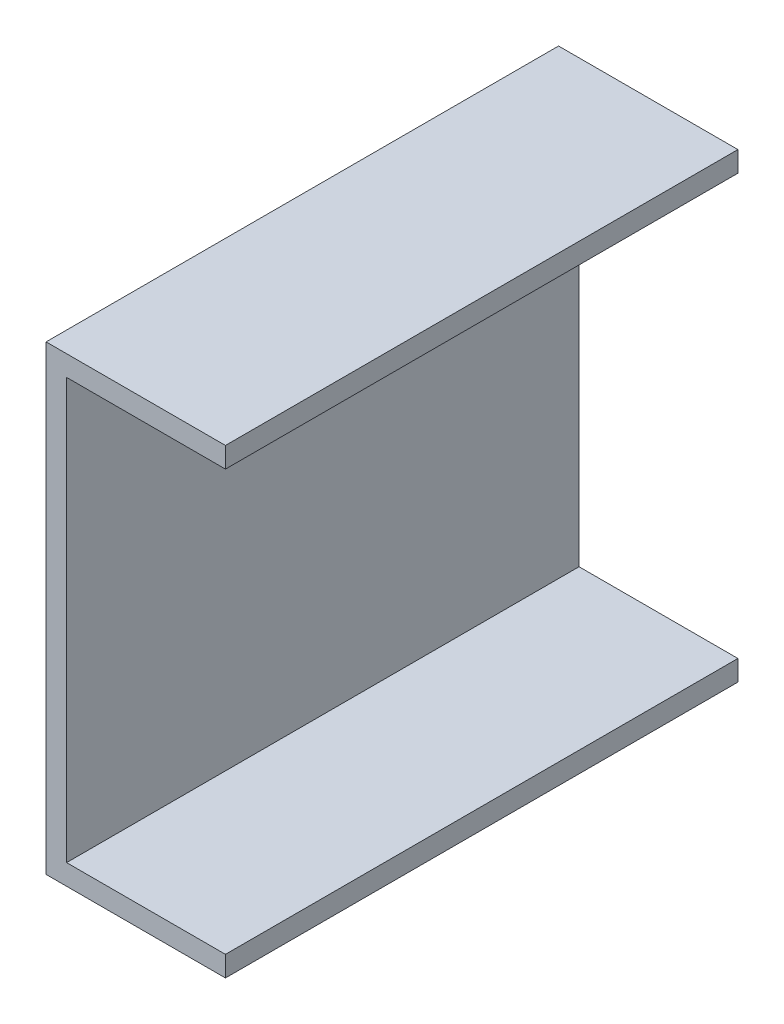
ISO-10303-21;
HEADER;
FILE_DESCRIPTION(('STEP AP214'),'2;1');
FILE_NAME('part.step','',(''),(''),'','','');
FILE_SCHEMA(('AUTOMOTIVE_DESIGN { 1 0 10303 214 1 1 1 1 }'));
ENDSEC;
DATA;
#1=APPLICATION_CONTEXT('core data for automotive mechanical design processes');
#2=APPLICATION_PROTOCOL_DEFINITION('international standard','automotive_design',2000,#1);
#3=PRODUCT_CONTEXT('',#1,'mechanical');
#4=PRODUCT('Part','Part','',(#3));
#5=PRODUCT_RELATED_PRODUCT_CATEGORY('part','',(#4));
#6=PRODUCT_DEFINITION_FORMATION('','',#4);
#7=PRODUCT_DEFINITION_CONTEXT('part definition',#1,'design');
#8=PRODUCT_DEFINITION('design','',#6,#7);
#9=PRODUCT_DEFINITION_SHAPE('','',#8);
#10=(LENGTH_UNIT() NAMED_UNIT(*) SI_UNIT(.MILLI.,.METRE.));
#11=(NAMED_UNIT(*) PLANE_ANGLE_UNIT() SI_UNIT($,.RADIAN.));
#12=(NAMED_UNIT(*) SI_UNIT($,.STERADIAN.) SOLID_ANGLE_UNIT());
#13=UNCERTAINTY_MEASURE_WITH_UNIT(LENGTH_MEASURE(1.E-05),#10,'distance_accuracy_value','');
#14=(GEOMETRIC_REPRESENTATION_CONTEXT(3) GLOBAL_UNCERTAINTY_ASSIGNED_CONTEXT((#13)) GLOBAL_UNIT_ASSIGNED_CONTEXT((#10,
#11,#12)) REPRESENTATION_CONTEXT('',''));
#15=CARTESIAN_POINT('',(0.,0.,0.));
#16=DIRECTION('',(0.,0.,1.));
#17=DIRECTION('',(1.,0.,0.));
#18=AXIS2_PLACEMENT_3D('',#15,#16,#17);
#19=CARTESIAN_POINT('',(0.,0.,200.));
#20=DIRECTION('',(1.,0.,0.));
#21=DIRECTION('',(0.,0.,-1.));
#22=AXIS2_PLACEMENT_3D('',#19,#20,#21);
#23=PLANE('',#22);
#24=DIRECTION('',(0.,-1.,0.));
#25=VECTOR('',#24,1.);
#26=CARTESIAN_POINT('',(0.,0.,0.));
#27=LINE('',#26,#25);
#28=CARTESIAN_POINT('',(0.,180.,0.));
#29=VERTEX_POINT('',#28);
#30=CARTESIAN_POINT('',(0.,0.,0.));
#31=VERTEX_POINT('',#30);
#32=EDGE_CURVE('E97',#29,#31,#27,.T.);
#33=ORIENTED_EDGE('',*,*,#32,.T.);
#34=DIRECTION('',(0.,0.,-1.));
#35=VECTOR('',#34,1.);
#36=CARTESIAN_POINT('',(0.,0.,200.));
#37=LINE('',#36,#35);
#38=CARTESIAN_POINT('',(0.,0.,200.));
#39=VERTEX_POINT('',#38);
#40=EDGE_CURVE('E11',#39,#31,#37,.T.);
#41=ORIENTED_EDGE('',*,*,#40,.F.);
#42=DIRECTION('',(0.,-1.,0.));
#43=VECTOR('',#42,1.);
#44=CARTESIAN_POINT('',(0.,0.,200.));
#45=LINE('',#44,#43);
#46=CARTESIAN_POINT('',(0.,180.,200.));
#47=VERTEX_POINT('',#46);
#48=EDGE_CURVE('E124',#47,#39,#45,.T.);
#49=ORIENTED_EDGE('',*,*,#48,.F.);
#50=DIRECTION('',(0.,0.,-1.));
#51=VECTOR('',#50,1.);
#52=CARTESIAN_POINT('',(0.,180.,200.));
#53=LINE('',#52,#51);
#54=EDGE_CURVE('E110',#47,#29,#53,.T.);
#55=ORIENTED_EDGE('',*,*,#54,.T.);
#56=EDGE_LOOP('',(#33,#41,#49,#55));
#57=FACE_BOUND('',#56,.T.);
#58=ADVANCED_FACE('F29',(#57),#23,.F.);
#59=CARTESIAN_POINT('',(0.,0.,200.));
#60=DIRECTION('',(0.,1.,0.));
#61=DIRECTION('',(0.,0.,1.));
#62=AXIS2_PLACEMENT_3D('',#59,#60,#61);
#63=PLANE('',#62);
#64=DIRECTION('',(1.,0.,0.));
#65=VECTOR('',#64,1.);
#66=CARTESIAN_POINT('',(0.,0.,0.));
#67=LINE('',#66,#65);
#68=CARTESIAN_POINT('',(70.,0.,0.));
#69=VERTEX_POINT('',#68);
#70=EDGE_CURVE('E93',#31,#69,#67,.T.);
#71=ORIENTED_EDGE('',*,*,#70,.T.);
#72=DIRECTION('',(0.,0.,-1.));
#73=VECTOR('',#72,1.);
#74=CARTESIAN_POINT('',(70.,0.,200.));
#75=LINE('',#74,#73);
#76=CARTESIAN_POINT('',(70.,0.,200.));
#77=VERTEX_POINT('',#76);
#78=EDGE_CURVE('E36',#77,#69,#75,.T.);
#79=ORIENTED_EDGE('',*,*,#78,.F.);
#80=DIRECTION('',(1.,0.,0.));
#81=VECTOR('',#80,1.);
#82=CARTESIAN_POINT('',(0.,0.,200.));
#83=LINE('',#82,#81);
#84=EDGE_CURVE('E106',#39,#77,#83,.T.);
#85=ORIENTED_EDGE('',*,*,#84,.F.);
#86=ORIENTED_EDGE('',*,*,#40,.T.);
#87=EDGE_LOOP('',(#71,#79,#85,#86));
#88=FACE_BOUND('',#87,.T.);
#89=ADVANCED_FACE('F105',(#88),#63,.F.);
#90=CARTESIAN_POINT('',(70.,0.,200.));
#91=DIRECTION('',(-1.,0.,0.));
#92=DIRECTION('',(0.,0.,1.));
#93=AXIS2_PLACEMENT_3D('',#90,#91,#92);
#94=PLANE('',#93);
#95=DIRECTION('',(0.,1.,0.));
#96=VECTOR('',#95,1.);
#97=CARTESIAN_POINT('',(70.,0.,0.));
#98=LINE('',#97,#96);
#99=CARTESIAN_POINT('',(70.,8.,0.));
#100=VERTEX_POINT('',#99);
#101=EDGE_CURVE('E99',#69,#100,#98,.T.);
#102=ORIENTED_EDGE('',*,*,#101,.T.);
#103=DIRECTION('',(0.,0.,-1.));
#104=VECTOR('',#103,1.);
#105=CARTESIAN_POINT('',(70.,8.,200.));
#106=LINE('',#105,#104);
#107=CARTESIAN_POINT('',(70.,8.,200.));
#108=VERTEX_POINT('',#107);
#109=EDGE_CURVE('E150',#108,#100,#106,.T.);
#110=ORIENTED_EDGE('',*,*,#109,.F.);
#111=DIRECTION('',(0.,1.,0.));
#112=VECTOR('',#111,1.);
#113=CARTESIAN_POINT('',(70.,0.,200.));
#114=LINE('',#113,#112);
#115=EDGE_CURVE('E127',#77,#108,#114,.T.);
#116=ORIENTED_EDGE('',*,*,#115,.F.);
#117=ORIENTED_EDGE('',*,*,#78,.T.);
#118=EDGE_LOOP('',(#102,#110,#116,#117));
#119=FACE_BOUND('',#118,.T.);
#120=ADVANCED_FACE('F154',(#119),#94,.F.);
#121=CARTESIAN_POINT('',(8.,8.,200.));
#122=DIRECTION('',(0.,-1.,0.));
#123=DIRECTION('',(0.,0.,-1.));
#124=AXIS2_PLACEMENT_3D('',#121,#122,#123);
#125=PLANE('',#124);
#126=DIRECTION('',(-1.,0.,0.));
#127=VECTOR('',#126,1.);
#128=CARTESIAN_POINT('',(8.,8.,0.));
#129=LINE('',#128,#127);
#130=CARTESIAN_POINT('',(8.,8.,0.));
#131=VERTEX_POINT('',#130);
#132=EDGE_CURVE('E114',#100,#131,#129,.T.);
#133=ORIENTED_EDGE('',*,*,#132,.T.);
#134=DIRECTION('',(0.,0.,-1.));
#135=VECTOR('',#134,1.);
#136=CARTESIAN_POINT('',(8.,8.,200.));
#137=LINE('',#136,#135);
#138=CARTESIAN_POINT('',(8.,8.,200.));
#139=VERTEX_POINT('',#138);
#140=EDGE_CURVE('E147',#139,#131,#137,.T.);
#141=ORIENTED_EDGE('',*,*,#140,.F.);
#142=DIRECTION('',(-1.,0.,0.));
#143=VECTOR('',#142,1.);
#144=CARTESIAN_POINT('',(8.,8.,200.));
#145=LINE('',#144,#143);
#146=EDGE_CURVE('E129',#108,#139,#145,.T.);
#147=ORIENTED_EDGE('',*,*,#146,.F.);
#148=ORIENTED_EDGE('',*,*,#109,.T.);
#149=EDGE_LOOP('',(#133,#141,#147,#148));
#150=FACE_BOUND('',#149,.T.);
#151=ADVANCED_FACE('F162',(#150),#125,.F.);
#152=CARTESIAN_POINT('',(8.,8.,200.));
#153=DIRECTION('',(-1.,0.,0.));
#154=DIRECTION('',(0.,0.,1.));
#155=AXIS2_PLACEMENT_3D('',#152,#153,#154);
#156=PLANE('',#155);
#157=DIRECTION('',(0.,1.,0.));
#158=VECTOR('',#157,1.);
#159=CARTESIAN_POINT('',(8.,8.,0.));
#160=LINE('',#159,#158);
#161=CARTESIAN_POINT('',(8.,172.,0.));
#162=VERTEX_POINT('',#161);
#163=EDGE_CURVE('E116',#131,#162,#160,.T.);
#164=ORIENTED_EDGE('',*,*,#163,.T.);
#165=DIRECTION('',(0.,0.,-1.));
#166=VECTOR('',#165,1.);
#167=CARTESIAN_POINT('',(8.,172.,200.));
#168=LINE('',#167,#166);
#169=CARTESIAN_POINT('',(8.,172.,200.));
#170=VERTEX_POINT('',#169);
#171=EDGE_CURVE('E144',#170,#162,#168,.T.);
#172=ORIENTED_EDGE('',*,*,#171,.F.);
#173=DIRECTION('',(0.,1.,0.));
#174=VECTOR('',#173,1.);
#175=CARTESIAN_POINT('',(8.,8.,200.));
#176=LINE('',#175,#174);
#177=EDGE_CURVE('E131',#139,#170,#176,.T.);
#178=ORIENTED_EDGE('',*,*,#177,.F.);
#179=ORIENTED_EDGE('',*,*,#140,.T.);
#180=EDGE_LOOP('',(#164,#172,#178,#179));
#181=FACE_BOUND('',#180,.T.);
#182=ADVANCED_FACE('F165',(#181),#156,.F.);
#183=CARTESIAN_POINT('',(8.,172.,200.));
#184=DIRECTION('',(0.,1.,0.));
#185=DIRECTION('',(0.,0.,1.));
#186=AXIS2_PLACEMENT_3D('',#183,#184,#185);
#187=PLANE('',#186);
#188=DIRECTION('',(1.,0.,0.));
#189=VECTOR('',#188,1.);
#190=CARTESIAN_POINT('',(8.,172.,0.));
#191=LINE('',#190,#189);
#192=CARTESIAN_POINT('',(70.,172.,0.));
#193=VERTEX_POINT('',#192);
#194=EDGE_CURVE('E118',#162,#193,#191,.T.);
#195=ORIENTED_EDGE('',*,*,#194,.T.);
#196=DIRECTION('',(0.,0.,-1.));
#197=VECTOR('',#196,1.);
#198=CARTESIAN_POINT('',(70.,172.,200.));
#199=LINE('',#198,#197);
#200=CARTESIAN_POINT('',(70.,172.,200.));
#201=VERTEX_POINT('',#200);
#202=EDGE_CURVE('E141',#201,#193,#199,.T.);
#203=ORIENTED_EDGE('',*,*,#202,.F.);
#204=DIRECTION('',(1.,0.,0.));
#205=VECTOR('',#204,1.);
#206=CARTESIAN_POINT('',(8.,172.,200.));
#207=LINE('',#206,#205);
#208=EDGE_CURVE('E133',#170,#201,#207,.T.);
#209=ORIENTED_EDGE('',*,*,#208,.F.);
#210=ORIENTED_EDGE('',*,*,#171,.T.);
#211=EDGE_LOOP('',(#195,#203,#209,#210));
#212=FACE_BOUND('',#211,.T.);
#213=ADVANCED_FACE('F170',(#212),#187,.F.);
#214=CARTESIAN_POINT('',(70.,172.,200.));
#215=DIRECTION('',(-1.,0.,0.));
#216=DIRECTION('',(0.,0.,1.));
#217=AXIS2_PLACEMENT_3D('',#214,#215,#216);
#218=PLANE('',#217);
#219=DIRECTION('',(0.,1.,0.));
#220=VECTOR('',#219,1.);
#221=CARTESIAN_POINT('',(70.,172.,0.));
#222=LINE('',#221,#220);
#223=CARTESIAN_POINT('',(70.,180.,0.));
#224=VERTEX_POINT('',#223);
#225=EDGE_CURVE('E120',#193,#224,#222,.T.);
#226=ORIENTED_EDGE('',*,*,#225,.T.);
#227=DIRECTION('',(0.,0.,-1.));
#228=VECTOR('',#227,1.);
#229=CARTESIAN_POINT('',(70.,180.,200.));
#230=LINE('',#229,#228);
#231=CARTESIAN_POINT('',(70.,180.,200.));
#232=VERTEX_POINT('',#231);
#233=EDGE_CURVE('E138',#232,#224,#230,.T.);
#234=ORIENTED_EDGE('',*,*,#233,.F.);
#235=DIRECTION('',(0.,1.,0.));
#236=VECTOR('',#235,1.);
#237=CARTESIAN_POINT('',(70.,172.,200.));
#238=LINE('',#237,#236);
#239=EDGE_CURVE('E48',#201,#232,#238,.T.);
#240=ORIENTED_EDGE('',*,*,#239,.F.);
#241=ORIENTED_EDGE('',*,*,#202,.T.);
#242=EDGE_LOOP('',(#226,#234,#240,#241));
#243=FACE_BOUND('',#242,.T.);
#244=ADVANCED_FACE('F173',(#243),#218,.F.);
#245=CARTESIAN_POINT('',(0.,180.,200.));
#246=DIRECTION('',(0.,-1.,0.));
#247=DIRECTION('',(0.,0.,-1.));
#248=AXIS2_PLACEMENT_3D('',#245,#246,#247);
#249=PLANE('',#248);
#250=DIRECTION('',(-1.,0.,0.));
#251=VECTOR('',#250,1.);
#252=CARTESIAN_POINT('',(0.,180.,0.));
#253=LINE('',#252,#251);
#254=EDGE_CURVE('E122',#224,#29,#253,.T.);
#255=ORIENTED_EDGE('',*,*,#254,.T.);
#256=ORIENTED_EDGE('',*,*,#54,.F.);
#257=DIRECTION('',(-1.,0.,0.));
#258=VECTOR('',#257,1.);
#259=CARTESIAN_POINT('',(0.,180.,200.));
#260=LINE('',#259,#258);
#261=EDGE_CURVE('E43',#232,#47,#260,.T.);
#262=ORIENTED_EDGE('',*,*,#261,.F.);
#263=ORIENTED_EDGE('',*,*,#233,.T.);
#264=EDGE_LOOP('',(#255,#256,#262,#263));
#265=FACE_BOUND('',#264,.T.);
#266=ADVANCED_FACE('F175',(#265),#249,.F.);
#267=CARTESIAN_POINT('',(0.,180.,200.));
#268=DIRECTION('',(0.,0.,-1.));
#269=DIRECTION('',(-1.,0.,0.));
#270=AXIS2_PLACEMENT_3D('',#267,#268,#269);
#271=PLANE('',#270);
#272=ORIENTED_EDGE('',*,*,#48,.T.);
#273=ORIENTED_EDGE('',*,*,#84,.T.);
#274=ORIENTED_EDGE('',*,*,#115,.T.);
#275=ORIENTED_EDGE('',*,*,#146,.T.);
#276=ORIENTED_EDGE('',*,*,#177,.T.);
#277=ORIENTED_EDGE('',*,*,#208,.T.);
#278=ORIENTED_EDGE('',*,*,#239,.T.);
#279=ORIENTED_EDGE('',*,*,#261,.T.);
#280=EDGE_LOOP('',(#272,#273,#274,#275,#276,#277,#278,#279));
#281=FACE_BOUND('',#280,.T.);
#282=ADVANCED_FACE('F157',(#281),#271,.F.);
#283=CARTESIAN_POINT('',(0.,180.,0.));
#284=DIRECTION('',(0.,0.,-1.));
#285=DIRECTION('',(-1.,0.,0.));
#286=AXIS2_PLACEMENT_3D('',#283,#284,#285);
#287=PLANE('',#286);
#288=ORIENTED_EDGE('',*,*,#32,.F.);
#289=ORIENTED_EDGE('',*,*,#254,.F.);
#290=ORIENTED_EDGE('',*,*,#225,.F.);
#291=ORIENTED_EDGE('',*,*,#194,.F.);
#292=ORIENTED_EDGE('',*,*,#163,.F.);
#293=ORIENTED_EDGE('',*,*,#132,.F.);
#294=ORIENTED_EDGE('',*,*,#101,.F.);
#295=ORIENTED_EDGE('',*,*,#70,.F.);
#296=EDGE_LOOP('',(#288,#289,#290,#291,#292,#293,#294,#295));
#297=FACE_BOUND('',#296,.T.);
#298=ADVANCED_FACE('F94',(#297),#287,.T.);
#299=CLOSED_SHELL('',(#58,#89,#120,#151,#182,#213,#244,#266,#282,#298));
#300=MANIFOLD_SOLID_BREP('B2',#299);
#301=ADVANCED_BREP_SHAPE_REPRESENTATION('',(#18,#300),#14);
#302=SHAPE_DEFINITION_REPRESENTATION(#9,#301);
ENDSEC;
END-ISO-10303-21;
